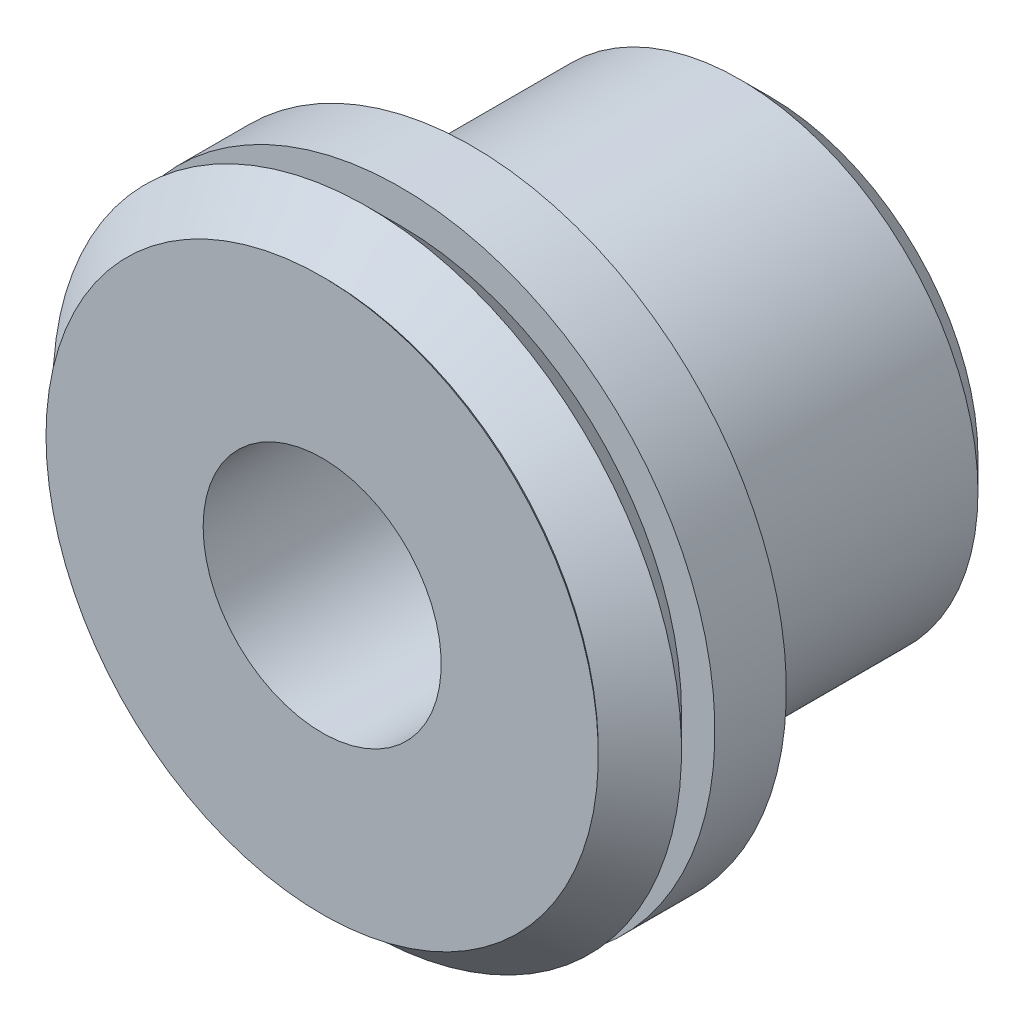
from build123d import *

# Parameters (mm, degrees)
SKETCH15_R                      = 6.35
SINGLE_ACTING_STUD_DEPTH        = 7.9375
SINGLE_ACTING_STUD_CHAMFER_SIZE = 0.79375
SKETCH3_R                       = 3.175
HOLE_CUT_DEPTH                  = 17.821923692


with BuildPart() as part:
    # Sketch1 → Base (revolve)
    with BuildSketch(Plane(origin=(0, 0, 0), x_dir=(0, 0, -1), z_dir=(1, 0, 0)), mode=Mode.PRIVATE) as base_sk:
        Polygon((0, 0), (0, 7.366), (0.09271, 7.27329), (1.20142, 8.382), (2.093214, 7.490206), (2.093214, 8.382), (3.998214, 8.382), (3.998214, 0), align=None)
    revolve(base_sk.sketch.rotate(Axis((0, 0, -71.294124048), (0, 0, 1)), 90), axis=Axis((0, 0, -71.294124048), (0, 0, 1)))

    # Sketch15 → Single Acting Stud (add)
    with BuildSketch(Plane.XY.offset(-3.998214)):
        Circle(SKETCH15_R)
    extrude(amount=-SINGLE_ACTING_STUD_DEPTH)

    # Single Acting Stud Chamfer
    single_acting_stud_chamfer_edges = [part.edges().sort_by_distance(p)[0] for p in [
        (-6.35, 0, -11.935714),
    ]]
    chamfer(single_acting_stud_chamfer_edges, length=SINGLE_ACTING_STUD_CHAMFER_SIZE)

    # Sketch3 → Hole Cut (cut, through all)
    with BuildSketch(Plane(origin=(0, 0, 0), x_dir=(-1, 0, 0), z_dir=(0, 0, -1))):
        Circle(SKETCH3_R)
    extrude(amount=HOLE_CUT_DEPTH, mode=Mode.SUBTRACT)


solid = part.part
